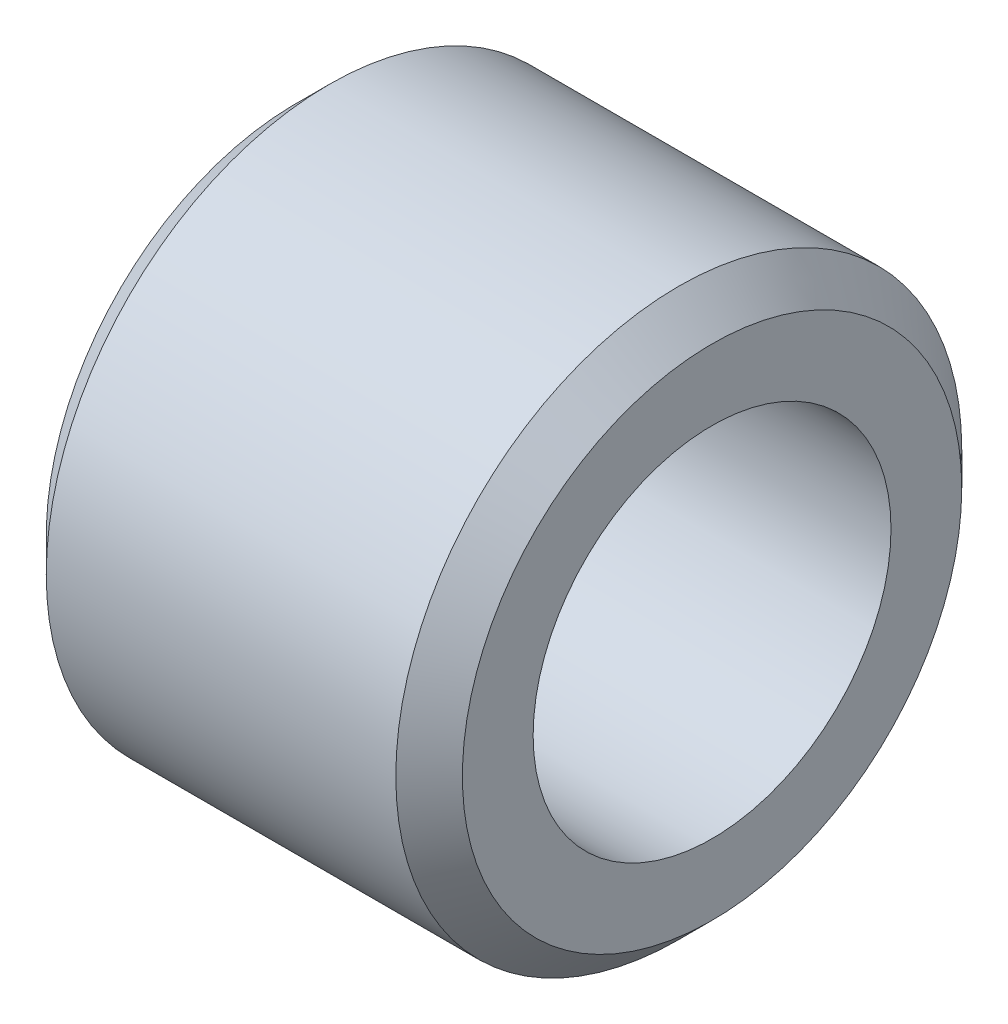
ISO-10303-21;
HEADER;
FILE_DESCRIPTION(('STEP AP214'),'2;1');
FILE_NAME('part.step','',(''),(''),'','','');
FILE_SCHEMA(('AUTOMOTIVE_DESIGN { 1 0 10303 214 1 1 1 1 }'));
ENDSEC;
DATA;
#1=APPLICATION_CONTEXT('core data for automotive mechanical design processes');
#2=APPLICATION_PROTOCOL_DEFINITION('international standard','automotive_design',2000,#1);
#3=PRODUCT_CONTEXT('',#1,'mechanical');
#4=PRODUCT('Part','Part','',(#3));
#5=PRODUCT_RELATED_PRODUCT_CATEGORY('part','',(#4));
#6=PRODUCT_DEFINITION_FORMATION('','',#4);
#7=PRODUCT_DEFINITION_CONTEXT('part definition',#1,'design');
#8=PRODUCT_DEFINITION('design','',#6,#7);
#9=PRODUCT_DEFINITION_SHAPE('','',#8);
#10=(LENGTH_UNIT() NAMED_UNIT(*) SI_UNIT(.MILLI.,.METRE.));
#11=(NAMED_UNIT(*) PLANE_ANGLE_UNIT() SI_UNIT($,.RADIAN.));
#12=(NAMED_UNIT(*) SI_UNIT($,.STERADIAN.) SOLID_ANGLE_UNIT());
#13=UNCERTAINTY_MEASURE_WITH_UNIT(LENGTH_MEASURE(1.E-05),#10,'distance_accuracy_value','');
#14=(GEOMETRIC_REPRESENTATION_CONTEXT(3) GLOBAL_UNCERTAINTY_ASSIGNED_CONTEXT((#13)) GLOBAL_UNIT_ASSIGNED_CONTEXT((#10,
#11,#12)) REPRESENTATION_CONTEXT('',''));
#15=CARTESIAN_POINT('',(0.,0.,0.));
#16=DIRECTION('',(0.,0.,1.));
#17=DIRECTION('',(1.,0.,0.));
#18=AXIS2_PLACEMENT_3D('',#15,#16,#17);
#19=CARTESIAN_POINT('',(0.,0.,2.7305));
#20=DIRECTION('',(1.,0.,0.));
#21=DIRECTION('',(0.,0.,-1.));
#22=AXIS2_PLACEMENT_3D('',#19,#20,#21);
#23=CYLINDRICAL_SURFACE('',#22,2.7305);
#24=DIRECTION('',(1.,0.,0.));
#25=VECTOR('',#24,1.);
#26=CARTESIAN_POINT('',(0.,0.,0.));
#27=LINE('',#26,#25);
#28=CARTESIAN_POINT('',(0.,0.,0.));
#29=VERTEX_POINT('',#28);
#30=CARTESIAN_POINT('',(6.35,0.,0.));
#31=VERTEX_POINT('',#30);
#32=EDGE_CURVE('E71',#29,#31,#27,.T.);
#33=ORIENTED_EDGE('',*,*,#32,.F.);
#34=CARTESIAN_POINT('',(0.,0.,2.7305));
#35=DIRECTION('',(1.,0.,0.));
#36=DIRECTION('',(0.,0.,-1.));
#37=AXIS2_PLACEMENT_3D('',#34,#35,#36);
#38=CIRCLE('',#37,2.7305);
#39=EDGE_CURVE('E75',#29,#29,#38,.T.);
#40=ORIENTED_EDGE('',*,*,#39,.F.);
#41=ORIENTED_EDGE('',*,*,#32,.T.);
#42=CARTESIAN_POINT('',(6.35,0.,2.7305));
#43=DIRECTION('',(1.,0.,0.));
#44=DIRECTION('',(0.,0.,-1.));
#45=AXIS2_PLACEMENT_3D('',#42,#43,#44);
#46=CIRCLE('',#45,2.7305);
#47=EDGE_CURVE('E69',#31,#31,#46,.T.);
#48=ORIENTED_EDGE('',*,*,#47,.T.);
#49=EDGE_LOOP('',(#33,#40,#41,#48));
#50=FACE_BOUND('',#49,.T.);
#51=ADVANCED_FACE('F35',(#50),#23,.F.);
#52=CARTESIAN_POINT('',(0.,0.,0.));
#53=DIRECTION('',(-1.,0.,0.));
#54=DIRECTION('',(0.,0.,1.));
#55=AXIS2_PLACEMENT_3D('',#52,#53,#54);
#56=PLANE('',#55);
#57=ORIENTED_EDGE('',*,*,#39,.T.);
#58=EDGE_LOOP('',(#57));
#59=FACE_BOUND('',#58,.T.);
#60=CARTESIAN_POINT('',(0.,0.,2.7305));
#61=DIRECTION('',(-1.,0.,0.));
#62=DIRECTION('',(0.,0.,1.));
#63=AXIS2_PLACEMENT_3D('',#60,#61,#62);
#64=CIRCLE('',#63,3.80999999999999);
#65=CARTESIAN_POINT('',(0.,0.,-1.07949999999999));
#66=VERTEX_POINT('',#65);
#67=EDGE_CURVE('E11',#66,#66,#64,.T.);
#68=ORIENTED_EDGE('',*,*,#67,.T.);
#69=EDGE_LOOP('',(#68));
#70=FACE_BOUND('',#69,.T.);
#71=ADVANCED_FACE('F109',(#59,#70),#56,.T.);
#72=CARTESIAN_POINT('',(0.,0.,2.7305));
#73=DIRECTION('',(1.,0.,0.));
#74=DIRECTION('',(0.,0.,-1.));
#75=AXIS2_PLACEMENT_3D('',#72,#73,#74);
#76=CYLINDRICAL_SURFACE('',#75,4.318);
#77=DIRECTION('',(-1.,0.,0.));
#78=VECTOR('',#77,1.);
#79=CARTESIAN_POINT('',(0.,0.,-1.5875));
#80=LINE('',#79,#78);
#81=CARTESIAN_POINT('',(5.842,0.,-1.5875));
#82=VERTEX_POINT('',#81);
#83=CARTESIAN_POINT('',(0.508000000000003,0.,-1.5875));
#84=VERTEX_POINT('',#83);
#85=EDGE_CURVE('E85',#82,#84,#80,.T.);
#86=ORIENTED_EDGE('',*,*,#85,.F.);
#87=CARTESIAN_POINT('',(5.842,0.,2.7305));
#88=DIRECTION('',(1.,0.,0.));
#89=DIRECTION('',(0.,0.,-1.));
#90=AXIS2_PLACEMENT_3D('',#87,#88,#89);
#91=CIRCLE('',#90,4.318);
#92=EDGE_CURVE('E45',#82,#82,#91,.F.);
#93=ORIENTED_EDGE('',*,*,#92,.T.);
#94=ORIENTED_EDGE('',*,*,#85,.T.);
#95=CARTESIAN_POINT('',(0.508000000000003,0.,2.7305));
#96=DIRECTION('',(-1.,0.,0.));
#97=DIRECTION('',(0.,0.,1.));
#98=AXIS2_PLACEMENT_3D('',#95,#96,#97);
#99=CIRCLE('',#98,4.318);
#100=EDGE_CURVE('E91',#84,#84,#99,.F.);
#101=ORIENTED_EDGE('',*,*,#100,.T.);
#102=EDGE_LOOP('',(#86,#93,#94,#101));
#103=FACE_BOUND('',#102,.T.);
#104=ADVANCED_FACE('F103',(#103),#76,.T.);
#105=CARTESIAN_POINT('',(6.35,0.,0.));
#106=DIRECTION('',(1.,0.,0.));
#107=DIRECTION('',(0.,0.,-1.));
#108=AXIS2_PLACEMENT_3D('',#105,#106,#107);
#109=PLANE('',#108);
#110=ORIENTED_EDGE('',*,*,#47,.F.);
#111=EDGE_LOOP('',(#110));
#112=FACE_BOUND('',#111,.T.);
#113=CARTESIAN_POINT('',(6.35,0.,2.7305));
#114=DIRECTION('',(1.,0.,0.));
#115=DIRECTION('',(0.,0.,-1.));
#116=AXIS2_PLACEMENT_3D('',#113,#114,#115);
#117=CIRCLE('',#116,3.81);
#118=CARTESIAN_POINT('',(6.35,0.,-1.0795));
#119=VERTEX_POINT('',#118);
#120=EDGE_CURVE('E78',#119,#119,#117,.T.);
#121=ORIENTED_EDGE('',*,*,#120,.T.);
#122=EDGE_LOOP('',(#121));
#123=FACE_BOUND('',#122,.T.);
#124=ADVANCED_FACE('F99',(#112,#123),#109,.T.);
#125=CARTESIAN_POINT('',(6.35,0.,2.7305));
#126=DIRECTION('',(-1.,0.,0.));
#127=DIRECTION('',(0.,0.,1.));
#128=AXIS2_PLACEMENT_3D('',#125,#126,#127);
#129=CONICAL_SURFACE('',#128,3.81,0.785398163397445);
#130=DIRECTION('',(0.70710678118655,0.,0.707106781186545));
#131=VECTOR('',#130,1.);
#132=CARTESIAN_POINT('',(5.842,0.,-1.5875));
#133=LINE('',#132,#131);
#134=EDGE_CURVE('E95',#82,#119,#133,.T.);
#135=ORIENTED_EDGE('',*,*,#134,.F.);
#136=ORIENTED_EDGE('',*,*,#92,.F.);
#137=ORIENTED_EDGE('',*,*,#134,.T.);
#138=ORIENTED_EDGE('',*,*,#120,.F.);
#139=EDGE_LOOP('',(#135,#136,#137,#138));
#140=FACE_BOUND('',#139,.T.);
#141=ADVANCED_FACE('F100',(#140),#129,.T.);
#142=CARTESIAN_POINT('',(0.508000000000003,0.,2.7305));
#143=DIRECTION('',(1.,0.,0.));
#144=DIRECTION('',(0.,0.,-1.));
#145=AXIS2_PLACEMENT_3D('',#142,#143,#144);
#146=CONICAL_SURFACE('',#145,4.318,0.78539816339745);
#147=DIRECTION('',(0.707106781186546,0.,-0.707106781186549));
#148=VECTOR('',#147,1.);
#149=CARTESIAN_POINT('',(0.,0.,-1.07949999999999));
#150=LINE('',#149,#148);
#151=EDGE_CURVE('E40',#66,#84,#150,.T.);
#152=ORIENTED_EDGE('',*,*,#151,.F.);
#153=ORIENTED_EDGE('',*,*,#67,.F.);
#154=ORIENTED_EDGE('',*,*,#151,.T.);
#155=ORIENTED_EDGE('',*,*,#100,.F.);
#156=EDGE_LOOP('',(#152,#153,#154,#155));
#157=FACE_BOUND('',#156,.T.);
#158=ADVANCED_FACE('F38',(#157),#146,.T.);
#159=CLOSED_SHELL('',(#51,#71,#104,#124,#141,#158));
#160=MANIFOLD_SOLID_BREP('B2',#159);
#161=ADVANCED_BREP_SHAPE_REPRESENTATION('',(#18,#160),#14);
#162=SHAPE_DEFINITION_REPRESENTATION(#9,#161);
ENDSEC;
END-ISO-10303-21;
